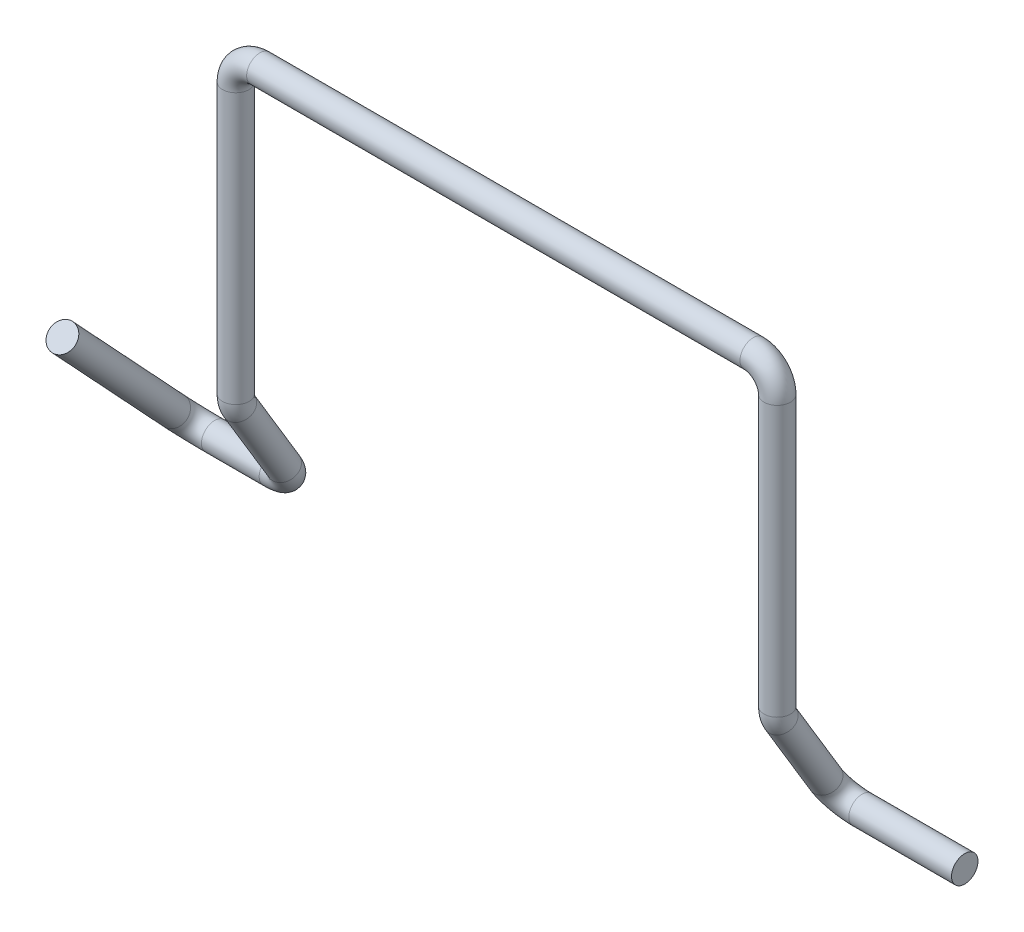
ISO-10303-21;
HEADER;
FILE_DESCRIPTION(('STEP AP214'),'2;1');
FILE_NAME('part.step','',(''),(''),'','','');
FILE_SCHEMA(('AUTOMOTIVE_DESIGN { 1 0 10303 214 1 1 1 1 }'));
ENDSEC;
DATA;
#1=APPLICATION_CONTEXT('core data for automotive mechanical design processes');
#2=APPLICATION_PROTOCOL_DEFINITION('international standard','automotive_design',2000,#1);
#3=PRODUCT_CONTEXT('',#1,'mechanical');
#4=PRODUCT('Part','Part','',(#3));
#5=PRODUCT_RELATED_PRODUCT_CATEGORY('part','',(#4));
#6=PRODUCT_DEFINITION_FORMATION('','',#4);
#7=PRODUCT_DEFINITION_CONTEXT('part definition',#1,'design');
#8=PRODUCT_DEFINITION('design','',#6,#7);
#9=PRODUCT_DEFINITION_SHAPE('','',#8);
#10=(LENGTH_UNIT() NAMED_UNIT(*) SI_UNIT(.MILLI.,.METRE.));
#11=(NAMED_UNIT(*) PLANE_ANGLE_UNIT() SI_UNIT($,.RADIAN.));
#12=(NAMED_UNIT(*) SI_UNIT($,.STERADIAN.) SOLID_ANGLE_UNIT());
#13=UNCERTAINTY_MEASURE_WITH_UNIT(LENGTH_MEASURE(1.E-05),#10,'distance_accuracy_value','');
#14=(GEOMETRIC_REPRESENTATION_CONTEXT(3) GLOBAL_UNCERTAINTY_ASSIGNED_CONTEXT((#13)) GLOBAL_UNIT_ASSIGNED_CONTEXT((#10,
#11,#12)) REPRESENTATION_CONTEXT('',''));
#15=CARTESIAN_POINT('',(0.,0.,0.));
#16=DIRECTION('',(0.,0.,1.));
#17=DIRECTION('',(1.,0.,0.));
#18=AXIS2_PLACEMENT_3D('',#15,#16,#17);
#19=CARTESIAN_POINT('',(-34.163,-20.2674807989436,-2.33426208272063));
#20=DIRECTION('',(0.,0.731353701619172,0.681998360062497));
#21=DIRECTION('',(0.,-0.681998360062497,0.731353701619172));
#22=AXIS2_PLACEMENT_3D('',#19,#20,#21);
#23=CYLINDRICAL_SURFACE('',#22,0.6985);
#24=CARTESIAN_POINT('',(-34.163,-20.2674807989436,-2.33426208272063));
#25=DIRECTION('',(0.,-0.731353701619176,-0.681998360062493));
#26=DIRECTION('',(-0.681998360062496,0.49878202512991,-0.534878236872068));
#27=AXIS2_PLACEMENT_3D('',#24,#25,#26);
#28=CIRCLE('',#27,0.6985);
#29=CARTESIAN_POINT('',(-34.8615,-20.2674807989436,-2.33426208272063));
#30=VERTEX_POINT('',#29);
#31=EDGE_CURVE('E39',#30,#30,#28,.T.);
#32=ORIENTED_EDGE('',*,*,#31,.F.);
#33=EDGE_LOOP('',(#32));
#34=FACE_BOUND('',#33,.T.);
#35=CARTESIAN_POINT('',(-34.163,-13.9422220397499,3.56413713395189));
#36=DIRECTION('',(0.,-0.731353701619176,-0.681998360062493));
#37=DIRECTION('',(-0.681998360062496,0.49878202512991,-0.534878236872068));
#38=AXIS2_PLACEMENT_3D('',#35,#36,#37);
#39=CIRCLE('',#38,0.6985);
#40=CARTESIAN_POINT('',(-34.6393758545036,-13.5938227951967,3.19052468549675));
#41=VERTEX_POINT('',#40);
#42=EDGE_CURVE('E10',#41,#41,#39,.T.);
#43=ORIENTED_EDGE('',*,*,#42,.T.);
#44=EDGE_LOOP('',(#43));
#45=FACE_BOUND('',#44,.T.);
#46=ADVANCED_FACE('F33',(#34,#45),#23,.T.);
#47=CARTESIAN_POINT('',(-32.893,-20.2674807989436,-2.33426208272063));
#48=DIRECTION('',(0.,0.681998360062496,-0.731353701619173));
#49=DIRECTION('',(0.,0.731353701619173,0.681998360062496));
#50=AXIS2_PLACEMENT_3D('',#47,#48,#49);
#51=TOROIDAL_SURFACE('',#50,1.27,0.6985);
#52=CARTESIAN_POINT('',(-32.893,-21.1963,-3.2004));
#53=DIRECTION('',(1.,0.,0.));
#54=DIRECTION('',(0.,0.,-1.));
#55=AXIS2_PLACEMENT_3D('',#52,#53,#54);
#56=CIRCLE('',#55,0.6985);
#57=CARTESIAN_POINT('',(-32.893,-21.707150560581,-3.67677585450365));
#58=VERTEX_POINT('',#57);
#59=EDGE_CURVE('E43',#58,#58,#56,.T.);
#60=CARTESIAN_POINT('',(-32.893,-20.2674807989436,-2.33426208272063));
#61=DIRECTION('',(0.,0.681998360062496,-0.731353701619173));
#62=DIRECTION('',(0.,0.731353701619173,0.681998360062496));
#63=AXIS2_PLACEMENT_3D('',#60,#61,#62);
#64=CIRCLE('',#63,1.9685);
#65=EDGE_CURVE('',#58,#30,#64,.T.);
#66=ORIENTED_EDGE('',*,*,#59,.F.);
#67=ORIENTED_EDGE('',*,*,#31,.T.);
#68=ORIENTED_EDGE('',*,*,#65,.T.);
#69=ORIENTED_EDGE('',*,*,#65,.F.);
#70=EDGE_LOOP('',(#66,#68,#67,#69));
#71=FACE_BOUND('',#70,.T.);
#72=ADVANCED_FACE('F161',(#71),#51,.T.);
#73=CARTESIAN_POINT('',(-29.845,-21.1963,-3.2004));
#74=DIRECTION('',(-1.,0.,0.));
#75=DIRECTION('',(0.,0.,1.));
#76=AXIS2_PLACEMENT_3D('',#73,#74,#75);
#77=CYLINDRICAL_SURFACE('',#76,0.6985);
#78=CARTESIAN_POINT('',(-29.845,-21.1963,-3.2004));
#79=DIRECTION('',(1.,0.,0.));
#80=DIRECTION('',(0.,0.,-1.));
#81=AXIS2_PLACEMENT_3D('',#78,#79,#80);
#82=CIRCLE('',#81,0.6985);
#83=CARTESIAN_POINT('',(-29.845,-21.7948803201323,-3.56040534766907));
#84=VERTEX_POINT('',#83);
#85=EDGE_CURVE('E47',#84,#84,#82,.T.);
#86=ORIENTED_EDGE('',*,*,#85,.F.);
#87=EDGE_LOOP('',(#86));
#88=FACE_BOUND('',#87,.T.);
#89=ORIENTED_EDGE('',*,*,#59,.T.);
#90=EDGE_LOOP('',(#89));
#91=FACE_BOUND('',#90,.T.);
#92=ADVANCED_FACE('F155',(#88,#91),#77,.T.);
#93=CARTESIAN_POINT('',(-29.845,-20.107972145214,-2.54584482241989));
#94=DIRECTION('',(0.,0.515397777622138,-0.856951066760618));
#95=DIRECTION('',(0.,0.856951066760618,0.515397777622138));
#96=AXIS2_PLACEMENT_3D('',#93,#94,#95);
#97=TOROIDAL_SURFACE('',#96,1.27,0.6985);
#98=CARTESIAN_POINT('',(-28.575,-20.107972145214,-2.54584482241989));
#99=DIRECTION('',(0.,0.856951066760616,0.515397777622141));
#100=DIRECTION('',(0.515397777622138,0.441670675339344,-0.734365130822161));
#101=AXIS2_PLACEMENT_3D('',#98,#99,#100);
#102=CIRCLE('',#101,0.6985);
#103=CARTESIAN_POINT('',(-27.8765,-20.107972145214,-2.54584482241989));
#104=VERTEX_POINT('',#103);
#105=EDGE_CURVE('E52',#104,#104,#102,.T.);
#106=CARTESIAN_POINT('',(-29.845,-20.107972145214,-2.54584482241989));
#107=DIRECTION('',(0.,0.515397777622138,-0.856951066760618));
#108=DIRECTION('',(0.,0.856951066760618,0.515397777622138));
#109=AXIS2_PLACEMENT_3D('',#106,#107,#108);
#110=CIRCLE('',#109,1.9685);
#111=EDGE_CURVE('',#104,#84,#110,.T.);
#112=ORIENTED_EDGE('',*,*,#105,.F.);
#113=ORIENTED_EDGE('',*,*,#85,.T.);
#114=ORIENTED_EDGE('',*,*,#111,.T.);
#115=ORIENTED_EDGE('',*,*,#111,.F.);
#116=EDGE_LOOP('',(#112,#114,#113,#115));
#117=FACE_BOUND('',#116,.T.);
#118=ADVANCED_FACE('F149',(#117),#97,.T.);
#119=CARTESIAN_POINT('',(-28.575,-16.1770659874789,-0.181672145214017));
#120=DIRECTION('',(0.,-0.856951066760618,-0.515397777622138));
#121=DIRECTION('',(0.,0.515397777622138,-0.856951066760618));
#122=AXIS2_PLACEMENT_3D('',#119,#120,#121);
#123=CYLINDRICAL_SURFACE('',#122,0.6985);
#124=CARTESIAN_POINT('',(-28.575,-16.1770659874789,-0.181672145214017));
#125=DIRECTION('',(0.,0.856951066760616,0.515397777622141));
#126=DIRECTION('',(0.515397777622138,0.441670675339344,-0.734365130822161));
#127=AXIS2_PLACEMENT_3D('',#124,#125,#126);
#128=CIRCLE('',#127,0.6985);
#129=CARTESIAN_POINT('',(-28.575,-16.5370713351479,0.416908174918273));
#130=VERTEX_POINT('',#129);
#131=EDGE_CURVE('E55',#130,#130,#128,.T.);
#132=ORIENTED_EDGE('',*,*,#131,.F.);
#133=EDGE_LOOP('',(#132));
#134=FACE_BOUND('',#133,.T.);
#135=ORIENTED_EDGE('',*,*,#105,.T.);
#136=EDGE_LOOP('',(#135));
#137=FACE_BOUND('',#136,.T.);
#138=ADVANCED_FACE('F143',(#134,#137),#123,.T.);
#139=CARTESIAN_POINT('',(-28.575,-15.5225108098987,-1.27));
#140=DIRECTION('',(1.,0.,0.));
#141=DIRECTION('',(0.,0.,-1.));
#142=AXIS2_PLACEMENT_3D('',#139,#140,#141);
#143=TOROIDAL_SURFACE('',#142,1.27,0.6985);
#144=CARTESIAN_POINT('',(-28.575,-15.5225108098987,0.));
#145=DIRECTION('',(0.,1.,0.));
#146=DIRECTION('',(0.515397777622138,0.,-0.856951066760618));
#147=AXIS2_PLACEMENT_3D('',#144,#145,#146);
#148=CIRCLE('',#147,0.6985);
#149=CARTESIAN_POINT('',(-28.575,-15.5225108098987,0.698499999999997));
#150=VERTEX_POINT('',#149);
#151=EDGE_CURVE('E58',#150,#150,#148,.T.);
#152=CARTESIAN_POINT('',(-28.575,-15.5225108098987,-1.27));
#153=DIRECTION('',(1.,0.,0.));
#154=DIRECTION('',(0.,0.,-1.));
#155=AXIS2_PLACEMENT_3D('',#152,#153,#154);
#156=CIRCLE('',#155,1.9685);
#157=EDGE_CURVE('',#150,#130,#156,.T.);
#158=ORIENTED_EDGE('',*,*,#151,.F.);
#159=ORIENTED_EDGE('',*,*,#131,.T.);
#160=ORIENTED_EDGE('',*,*,#157,.T.);
#161=ORIENTED_EDGE('',*,*,#157,.F.);
#162=EDGE_LOOP('',(#158,#160,#159,#161));
#163=FACE_BOUND('',#162,.T.);
#164=ADVANCED_FACE('F137',(#163),#143,.T.);
#165=CARTESIAN_POINT('',(-28.575,-1.27,0.));
#166=DIRECTION('',(0.,-1.,0.));
#167=DIRECTION('',(0.,0.,-1.));
#168=AXIS2_PLACEMENT_3D('',#165,#166,#167);
#169=CYLINDRICAL_SURFACE('',#168,0.6985);
#170=CARTESIAN_POINT('',(-28.575,-1.27,0.));
#171=DIRECTION('',(0.,1.,0.));
#172=DIRECTION('',(0.515397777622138,0.,-0.856951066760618));
#173=AXIS2_PLACEMENT_3D('',#170,#171,#172);
#174=CIRCLE('',#173,0.6985);
#175=CARTESIAN_POINT('',(-29.2735,-1.27,0.));
#176=VERTEX_POINT('',#175);
#177=EDGE_CURVE('E61',#176,#176,#174,.T.);
#178=ORIENTED_EDGE('',*,*,#177,.F.);
#179=EDGE_LOOP('',(#178));
#180=FACE_BOUND('',#179,.T.);
#181=ORIENTED_EDGE('',*,*,#151,.T.);
#182=EDGE_LOOP('',(#181));
#183=FACE_BOUND('',#182,.T.);
#184=ADVANCED_FACE('F131',(#180,#183),#169,.T.);
#185=CARTESIAN_POINT('',(-27.305,-1.27,0.));
#186=DIRECTION('',(0.,0.,1.));
#187=DIRECTION('',(0.,-1.,0.));
#188=AXIS2_PLACEMENT_3D('',#185,#186,#187);
#189=TOROIDAL_SURFACE('',#188,1.27,0.6985);
#190=CARTESIAN_POINT('',(-27.305,0.,0.));
#191=DIRECTION('',(1.,0.,0.));
#192=DIRECTION('',(0.,-0.515397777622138,-0.856951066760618));
#193=AXIS2_PLACEMENT_3D('',#190,#191,#192);
#194=CIRCLE('',#193,0.6985);
#195=CARTESIAN_POINT('',(-27.305,0.6985,0.));
#196=VERTEX_POINT('',#195);
#197=EDGE_CURVE('E64',#196,#196,#194,.T.);
#198=CARTESIAN_POINT('',(-27.305,-1.27,0.));
#199=DIRECTION('',(0.,0.,1.));
#200=DIRECTION('',(0.,-1.,0.));
#201=AXIS2_PLACEMENT_3D('',#198,#199,#200);
#202=CIRCLE('',#201,1.9685);
#203=EDGE_CURVE('',#196,#176,#202,.T.);
#204=ORIENTED_EDGE('',*,*,#197,.F.);
#205=ORIENTED_EDGE('',*,*,#177,.T.);
#206=ORIENTED_EDGE('',*,*,#203,.T.);
#207=ORIENTED_EDGE('',*,*,#203,.F.);
#208=EDGE_LOOP('',(#204,#206,#205,#207));
#209=FACE_BOUND('',#208,.T.);
#210=ADVANCED_FACE('F125',(#209),#189,.T.);
#211=CARTESIAN_POINT('',(-1.27,0.,0.));
#212=DIRECTION('',(-1.,0.,0.));
#213=DIRECTION('',(0.,0.,1.));
#214=AXIS2_PLACEMENT_3D('',#211,#212,#213);
#215=CYLINDRICAL_SURFACE('',#214,0.6985);
#216=CARTESIAN_POINT('',(-1.27,0.,0.));
#217=DIRECTION('',(1.,0.,0.));
#218=DIRECTION('',(0.,-0.515397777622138,-0.856951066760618));
#219=AXIS2_PLACEMENT_3D('',#216,#217,#218);
#220=CIRCLE('',#219,0.6985);
#221=CARTESIAN_POINT('',(-1.26999999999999,0.698500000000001,0.));
#222=VERTEX_POINT('',#221);
#223=EDGE_CURVE('E67',#222,#222,#220,.T.);
#224=ORIENTED_EDGE('',*,*,#223,.F.);
#225=EDGE_LOOP('',(#224));
#226=FACE_BOUND('',#225,.T.);
#227=ORIENTED_EDGE('',*,*,#197,.T.);
#228=EDGE_LOOP('',(#227));
#229=FACE_BOUND('',#228,.T.);
#230=ADVANCED_FACE('F119',(#226,#229),#215,.T.);
#231=CARTESIAN_POINT('',(-1.27,-1.27,0.));
#232=DIRECTION('',(0.,0.,1.));
#233=DIRECTION('',(0.,-1.,0.));
#234=AXIS2_PLACEMENT_3D('',#231,#232,#233);
#235=TOROIDAL_SURFACE('',#234,1.27,0.6985);
#236=CARTESIAN_POINT('',(0.,-1.27,0.));
#237=DIRECTION('',(0.,-1.,0.));
#238=DIRECTION('',(-0.515397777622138,0.,-0.856951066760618));
#239=AXIS2_PLACEMENT_3D('',#236,#237,#238);
#240=CIRCLE('',#239,0.6985);
#241=CARTESIAN_POINT('',(0.6985,-1.27,0.));
#242=VERTEX_POINT('',#241);
#243=EDGE_CURVE('E70',#242,#242,#240,.T.);
#244=CARTESIAN_POINT('',(-1.27,-1.27,0.));
#245=DIRECTION('',(0.,0.,1.));
#246=DIRECTION('',(0.,-1.,0.));
#247=AXIS2_PLACEMENT_3D('',#244,#245,#246);
#248=CIRCLE('',#247,1.9685);
#249=EDGE_CURVE('',#242,#222,#248,.T.);
#250=ORIENTED_EDGE('',*,*,#243,.F.);
#251=ORIENTED_EDGE('',*,*,#223,.T.);
#252=ORIENTED_EDGE('',*,*,#249,.T.);
#253=ORIENTED_EDGE('',*,*,#249,.F.);
#254=EDGE_LOOP('',(#250,#252,#251,#253));
#255=FACE_BOUND('',#254,.T.);
#256=ADVANCED_FACE('F113',(#255),#235,.T.);
#257=CARTESIAN_POINT('',(0.,-15.5225108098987,0.));
#258=DIRECTION('',(0.,1.,0.));
#259=DIRECTION('',(0.,0.,1.));
#260=AXIS2_PLACEMENT_3D('',#257,#258,#259);
#261=CYLINDRICAL_SURFACE('',#260,0.6985);
#262=CARTESIAN_POINT('',(0.,-15.5225108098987,0.));
#263=DIRECTION('',(0.,-1.,0.));
#264=DIRECTION('',(-0.515397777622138,0.,-0.856951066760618));
#265=AXIS2_PLACEMENT_3D('',#262,#263,#264);
#266=CIRCLE('',#265,0.6985);
#267=CARTESIAN_POINT('',(0.,-15.5225108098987,0.698499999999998));
#268=VERTEX_POINT('',#267);
#269=EDGE_CURVE('E73',#268,#268,#266,.T.);
#270=ORIENTED_EDGE('',*,*,#269,.F.);
#271=EDGE_LOOP('',(#270));
#272=FACE_BOUND('',#271,.T.);
#273=ORIENTED_EDGE('',*,*,#243,.T.);
#274=EDGE_LOOP('',(#273));
#275=FACE_BOUND('',#274,.T.);
#276=ADVANCED_FACE('F107',(#272,#275),#261,.T.);
#277=CARTESIAN_POINT('',(0.,-15.5225108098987,-1.27));
#278=DIRECTION('',(-1.,0.,0.));
#279=DIRECTION('',(0.,0.,1.));
#280=AXIS2_PLACEMENT_3D('',#277,#278,#279);
#281=TOROIDAL_SURFACE('',#280,1.27,0.6985);
#282=CARTESIAN_POINT('',(0.,-16.1770659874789,-0.181672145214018));
#283=DIRECTION('',(0.,-0.856951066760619,-0.515397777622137));
#284=DIRECTION('',(-0.515397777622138,0.441670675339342,-0.734365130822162));
#285=AXIS2_PLACEMENT_3D('',#282,#283,#284);
#286=CIRCLE('',#285,0.6985);
#287=CARTESIAN_POINT('',(0.,-16.5370713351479,0.416908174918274));
#288=VERTEX_POINT('',#287);
#289=EDGE_CURVE('E76',#288,#288,#286,.T.);
#290=CARTESIAN_POINT('',(0.,-15.5225108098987,-1.27));
#291=DIRECTION('',(-1.,0.,0.));
#292=DIRECTION('',(0.,0.,1.));
#293=AXIS2_PLACEMENT_3D('',#290,#291,#292);
#294=CIRCLE('',#293,1.9685);
#295=EDGE_CURVE('',#288,#268,#294,.T.);
#296=ORIENTED_EDGE('',*,*,#289,.F.);
#297=ORIENTED_EDGE('',*,*,#269,.T.);
#298=ORIENTED_EDGE('',*,*,#295,.T.);
#299=ORIENTED_EDGE('',*,*,#295,.F.);
#300=EDGE_LOOP('',(#296,#298,#297,#299));
#301=FACE_BOUND('',#300,.T.);
#302=ADVANCED_FACE('F101',(#301),#281,.T.);
#303=CARTESIAN_POINT('',(0.,-20.107972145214,-2.54584482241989));
#304=DIRECTION('',(0.,0.856951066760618,0.515397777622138));
#305=DIRECTION('',(0.,-0.515397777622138,0.856951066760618));
#306=AXIS2_PLACEMENT_3D('',#303,#304,#305);
#307=CYLINDRICAL_SURFACE('',#306,0.6985);
#308=CARTESIAN_POINT('',(0.,-20.107972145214,-2.54584482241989));
#309=DIRECTION('',(0.,-0.856951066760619,-0.515397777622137));
#310=DIRECTION('',(-0.515397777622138,0.441670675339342,-0.734365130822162));
#311=AXIS2_PLACEMENT_3D('',#308,#309,#310);
#312=CIRCLE('',#311,0.6985);
#313=CARTESIAN_POINT('',(-0.698500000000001,-20.107972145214,-2.54584482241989));
#314=VERTEX_POINT('',#313);
#315=EDGE_CURVE('E79',#314,#314,#312,.T.);
#316=ORIENTED_EDGE('',*,*,#315,.F.);
#317=EDGE_LOOP('',(#316));
#318=FACE_BOUND('',#317,.T.);
#319=ORIENTED_EDGE('',*,*,#289,.T.);
#320=EDGE_LOOP('',(#319));
#321=FACE_BOUND('',#320,.T.);
#322=ADVANCED_FACE('F95',(#318,#321),#307,.T.);
#323=CARTESIAN_POINT('',(1.27,-20.107972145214,-2.54584482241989));
#324=DIRECTION('',(0.,0.515397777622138,-0.856951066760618));
#325=DIRECTION('',(0.,0.856951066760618,0.515397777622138));
#326=AXIS2_PLACEMENT_3D('',#323,#324,#325);
#327=TOROIDAL_SURFACE('',#326,1.27,0.6985);
#328=CARTESIAN_POINT('',(1.27,-21.1963,-3.2004));
#329=DIRECTION('',(1.,0.,0.));
#330=DIRECTION('',(0.,0.,-1.));
#331=AXIS2_PLACEMENT_3D('',#328,#329,#330);
#332=CIRCLE('',#331,0.6985);
#333=CARTESIAN_POINT('',(1.27,-21.7948803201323,-3.56040534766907));
#334=VERTEX_POINT('',#333);
#335=EDGE_CURVE('E82',#334,#334,#332,.T.);
#336=CARTESIAN_POINT('',(1.27,-20.107972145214,-2.54584482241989));
#337=DIRECTION('',(0.,0.515397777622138,-0.856951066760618));
#338=DIRECTION('',(0.,0.856951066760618,0.515397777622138));
#339=AXIS2_PLACEMENT_3D('',#336,#337,#338);
#340=CIRCLE('',#339,1.9685);
#341=EDGE_CURVE('',#334,#314,#340,.T.);
#342=ORIENTED_EDGE('',*,*,#335,.F.);
#343=ORIENTED_EDGE('',*,*,#315,.T.);
#344=ORIENTED_EDGE('',*,*,#341,.T.);
#345=ORIENTED_EDGE('',*,*,#341,.F.);
#346=EDGE_LOOP('',(#342,#344,#343,#345));
#347=FACE_BOUND('',#346,.T.);
#348=ADVANCED_FACE('F92',(#347),#327,.T.);
#349=CARTESIAN_POINT('',(1.27,-21.1963,-3.2004));
#350=DIRECTION('',(1.,0.,0.));
#351=DIRECTION('',(0.,0.,-1.));
#352=AXIS2_PLACEMENT_3D('',#349,#350,#351);
#353=CYLINDRICAL_SURFACE('',#352,0.6985);
#354=ORIENTED_EDGE('',*,*,#335,.T.);
#355=EDGE_LOOP('',(#354));
#356=FACE_BOUND('',#355,.T.);
#357=CARTESIAN_POINT('',(6.6929,-21.1963,-3.2004));
#358=DIRECTION('',(1.,0.,0.));
#359=DIRECTION('',(0.,0.,-1.));
#360=AXIS2_PLACEMENT_3D('',#357,#358,#359);
#361=CIRCLE('',#360,0.6985);
#362=CARTESIAN_POINT('',(6.6929,-21.1963,-3.8989));
#363=VERTEX_POINT('',#362);
#364=EDGE_CURVE('E83',#363,#363,#361,.T.);
#365=ORIENTED_EDGE('',*,*,#364,.F.);
#366=EDGE_LOOP('',(#365));
#367=FACE_BOUND('',#366,.T.);
#368=ADVANCED_FACE('F89',(#356,#367),#353,.T.);
#369=CARTESIAN_POINT('',(-34.163,-13.9422220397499,3.56413713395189));
#370=DIRECTION('',(0.,-0.731353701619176,-0.681998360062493));
#371=DIRECTION('',(-0.681998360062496,0.49878202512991,-0.534878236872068));
#372=AXIS2_PLACEMENT_3D('',#369,#370,#371);
#373=PLANE('',#372);
#374=ORIENTED_EDGE('',*,*,#42,.F.);
#375=EDGE_LOOP('',(#374));
#376=FACE_BOUND('',#375,.T.);
#377=ADVANCED_FACE('F173',(#376),#373,.F.);
#378=CARTESIAN_POINT('',(6.6929,-21.1963,-3.2004));
#379=DIRECTION('',(1.,0.,0.));
#380=DIRECTION('',(0.,0.,-1.));
#381=AXIS2_PLACEMENT_3D('',#378,#379,#380);
#382=PLANE('',#381);
#383=ORIENTED_EDGE('',*,*,#364,.T.);
#384=EDGE_LOOP('',(#383));
#385=FACE_BOUND('',#384,.T.);
#386=ADVANCED_FACE('F174',(#385),#382,.T.);
#387=CLOSED_SHELL('',(#46,#72,#92,#118,#138,#164,#184,#210,#230,#256,#276,#302,#322,#348,#368,
#377,#386));
#388=MANIFOLD_SOLID_BREP('B2',#387);
#389=ADVANCED_BREP_SHAPE_REPRESENTATION('',(#18,#388),#14);
#390=SHAPE_DEFINITION_REPRESENTATION(#9,#389);
ENDSEC;
END-ISO-10303-21;
